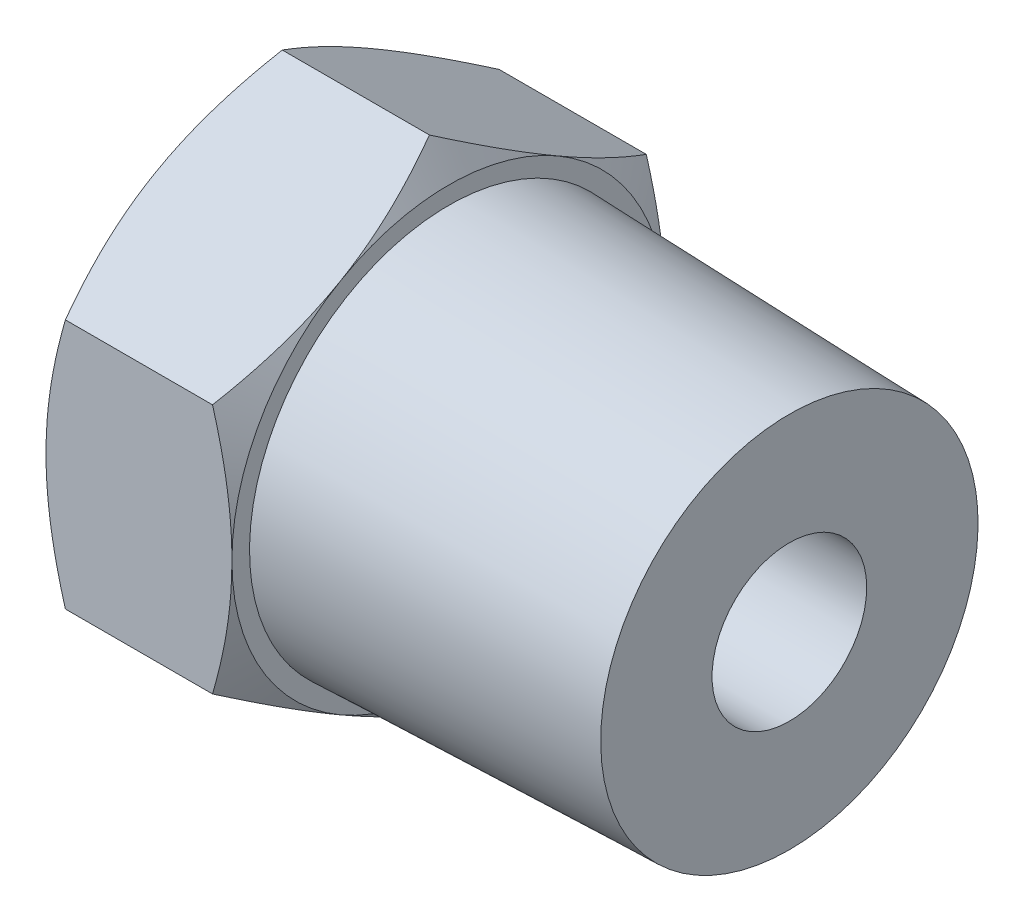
ISO-10303-21;
HEADER;
FILE_DESCRIPTION(('STEP AP214'),'2;1');
FILE_NAME('part.step','',(''),(''),'','','');
FILE_SCHEMA(('AUTOMOTIVE_DESIGN { 1 0 10303 214 1 1 1 1 }'));
ENDSEC;
DATA;
#1=APPLICATION_CONTEXT('core data for automotive mechanical design processes');
#2=APPLICATION_PROTOCOL_DEFINITION('international standard','automotive_design',2000,#1);
#3=PRODUCT_CONTEXT('',#1,'mechanical');
#4=PRODUCT('Part','Part','',(#3));
#5=PRODUCT_RELATED_PRODUCT_CATEGORY('part','',(#4));
#6=PRODUCT_DEFINITION_FORMATION('','',#4);
#7=PRODUCT_DEFINITION_CONTEXT('part definition',#1,'design');
#8=PRODUCT_DEFINITION('design','',#6,#7);
#9=PRODUCT_DEFINITION_SHAPE('','',#8);
#10=(LENGTH_UNIT() NAMED_UNIT(*) SI_UNIT(.MILLI.,.METRE.));
#11=(NAMED_UNIT(*) PLANE_ANGLE_UNIT() SI_UNIT($,.RADIAN.));
#12=(NAMED_UNIT(*) SI_UNIT($,.STERADIAN.) SOLID_ANGLE_UNIT());
#13=UNCERTAINTY_MEASURE_WITH_UNIT(LENGTH_MEASURE(1.E-05),#10,'distance_accuracy_value','');
#14=(GEOMETRIC_REPRESENTATION_CONTEXT(3) GLOBAL_UNCERTAINTY_ASSIGNED_CONTEXT((#13)) GLOBAL_UNIT_ASSIGNED_CONTEXT((#10,
#11,#12)) REPRESENTATION_CONTEXT('',''));
#15=CARTESIAN_POINT('',(0.,0.,0.));
#16=DIRECTION('',(0.,0.,1.));
#17=DIRECTION('',(1.,0.,0.));
#18=AXIS2_PLACEMENT_3D('',#15,#16,#17);
#19=CARTESIAN_POINT('',(4.791075,3.2079024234,5.55625));
#20=DIRECTION('',(0.,0.866025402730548,0.500000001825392));
#21=DIRECTION('',(0.,0.500000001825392,-0.866025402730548));
#22=AXIS2_PLACEMENT_3D('',#19,#20,#21);
#23=PLANE('',#22);
#24=CARTESIAN_POINT('',(4.76250000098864,4.81185364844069,2.7781249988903));
#25=CARTESIAN_POINT('',(4.762522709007,4.87993238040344,2.66020917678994));
#26=CARTESIAN_POINT('',(4.75961098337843,4.94800783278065,2.54229903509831));
#27=CARTESIAN_POINT('',(4.74808744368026,5.08402507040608,2.30671026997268));
#28=CARTESIAN_POINT('',(4.7394767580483,5.15196687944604,2.18903160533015));
#29=CARTESIAN_POINT('',(4.71678077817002,5.28727798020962,1.95466590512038));
#30=CARTESIAN_POINT('',(4.70272304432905,5.35464843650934,1.83797685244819));
#31=CARTESIAN_POINT('',(4.66943535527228,5.4890683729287,1.60515469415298));
#32=CARTESIAN_POINT('',(4.65020526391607,5.5561178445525,1.48902160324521));
#33=CARTESIAN_POINT('',(4.58535052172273,5.75650685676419,1.14193765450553));
#34=CARTESIAN_POINT('',(4.53252991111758,5.88926425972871,0.911995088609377));
#35=CARTESIAN_POINT('',(4.41071207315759,6.15363741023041,0.45408736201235));
#36=CARTESIAN_POINT('',(4.34163405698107,6.28524393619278,0.226138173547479));
#37=CARTESIAN_POINT('',(4.26623574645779,6.41580488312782,-1.8927537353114E-08));
#38=B_SPLINE_CURVE_WITH_KNOTS('',3,(#24,#25,#26,#27,#28,#29,#30,#31,#32,#33,#34,#35,#36,#37),
.UNSPECIFIED.,.F.,.F.,(4,2,2,2,2,2,4),(0.,0.408430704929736,0.81678056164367,1.22309071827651,
1.6294115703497,2.44098831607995,3.25668655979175),.UNSPECIFIED.);
#39=CARTESIAN_POINT('',(4.76250000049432,4.8118536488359,2.77812499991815));
#40=VERTEX_POINT('',#39);
#41=CARTESIAN_POINT('',(4.26623576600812,6.41580484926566,-3.97234481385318E-08));
#42=VERTEX_POINT('',#41);
#43=EDGE_CURVE('E326',#40,#42,#38,.T.);
#44=ORIENTED_EDGE('',*,*,#43,.T.);
#45=DIRECTION('',(1.,0.,0.));
#46=VECTOR('',#45,1.);
#47=CARTESIAN_POINT('',(2.38125,6.4158048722,0.));
#48=LINE('',#47,#46);
#49=CARTESIAN_POINT('',(0.49626424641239,6.4158048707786,2.46192904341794E-09));
#50=VERTEX_POINT('',#49);
#51=EDGE_CURVE('E336',#50,#42,#48,.T.);
#52=ORIENTED_EDGE('',*,*,#51,.F.);
#53=CARTESIAN_POINT('',(0.496264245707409,6.41580486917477,4.85708082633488E-09));
#54=CARTESIAN_POINT('',(0.420865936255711,6.28524392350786,0.226138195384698));
#55=CARTESIAN_POINT('',(0.351787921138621,6.15363739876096,0.45408738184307));
#56=CARTESIAN_POINT('',(0.22997008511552,5.88926425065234,0.911995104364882));
#57=CARTESIAN_POINT('',(0.177149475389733,5.75650684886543,1.14193766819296));
#58=CARTESIAN_POINT('',(0.112294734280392,5.55611783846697,1.48902161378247));
#59=CARTESIAN_POINT('',(0.0930646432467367,5.48906836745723,1.60515470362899));
#60=CARTESIAN_POINT('',(0.0597769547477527,5.35464843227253,1.83797685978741));
#61=CARTESIAN_POINT('',(0.0457192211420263,5.28727797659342,1.95466591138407));
#62=CARTESIAN_POINT('',(0.0230232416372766,5.1519668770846,2.18903160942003));
#63=CARTESIAN_POINT('',(0.0144125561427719,5.08402506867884,2.30671027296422));
#64=CARTESIAN_POINT('',(0.00288901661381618,4.94800783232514,2.5422990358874));
#65=CARTESIAN_POINT('',(-2.27089830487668E-05,4.87993238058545,2.66020917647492));
#66=CARTESIAN_POINT('',(-9.88643838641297E-10,4.81185364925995,2.7781249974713));
#67=B_SPLINE_CURVE_WITH_KNOTS('',3,(#53,#54,#55,#56,#57,#58,#59,#60,#61,#62,#63,#64,#65,#66),
.UNSPECIFIED.,.F.,.F.,(4,2,2,2,2,2,4),(0.,0.815698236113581,1.62727497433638,2.03359582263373,
2.43990597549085,2.84825582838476,3.25668652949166),.UNSPECIFIED.);
#68=CARTESIAN_POINT('',(0.,4.81185364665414,2.77812500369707));
#69=VERTEX_POINT('',#68);
#70=EDGE_CURVE('E368',#50,#69,#67,.T.);
#71=ORIENTED_EDGE('',*,*,#70,.T.);
#72=CARTESIAN_POINT('',(-9.88643837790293E-10,4.81185364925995,2.7781249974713));
#73=CARTESIAN_POINT('',(-2.27093693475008E-05,4.74377491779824,2.89604081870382));
#74=CARTESIAN_POINT('',(0.00288901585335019,4.67569946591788,3.01395095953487));
#75=CARTESIAN_POINT('',(0.0144125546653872,4.53968222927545,3.2495397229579));
#76=CARTESIAN_POINT('',(0.0230232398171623,4.47174042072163,3.36721838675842));
#77=CARTESIAN_POINT('',(0.0457192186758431,4.33642932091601,3.60158408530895));
#78=CARTESIAN_POINT('',(0.0597769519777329,4.26905886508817,3.71827313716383));
#79=CARTESIAN_POINT('',(0.0930646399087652,4.13463892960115,3.95109529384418));
#80=CARTESIAN_POINT('',(0.112294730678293,4.06758945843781,4.0672283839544));
#81=CARTESIAN_POINT('',(0.177149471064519,3.86720044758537,4.41431233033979));
#82=CARTESIAN_POINT('',(0.229970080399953,3.73444304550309,4.64425489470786));
#83=CARTESIAN_POINT('',(0.351787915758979,3.4700698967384,5.1021626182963));
#84=CARTESIAN_POINT('',(0.420865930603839,3.33846337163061,5.33011180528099));
#85=CARTESIAN_POINT('',(0.496264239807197,3.20790242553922,5.55624999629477));
#86=B_SPLINE_CURVE_WITH_KNOTS('',3,(#72,#73,#74,#75,#76,#77,#78,#79,#80,#81,#82,#83,#84,#85),
.UNSPECIFIED.,.F.,.F.,(4,2,2,2,2,2,4),(0.,0.408430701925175,0.816780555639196,1.22309070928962,
1.62941155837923,2.44098829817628,3.25668653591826),.UNSPECIFIED.);
#87=CARTESIAN_POINT('',(0.496264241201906,3.20790242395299,5.55625));
#88=VERTEX_POINT('',#87);
#89=EDGE_CURVE('E190',#69,#88,#86,.T.);
#90=ORIENTED_EDGE('',*,*,#89,.T.);
#91=DIRECTION('',(-1.,0.,0.));
#92=VECTOR('',#91,1.);
#93=CARTESIAN_POINT('',(2.38125,3.2079024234,5.55625));
#94=LINE('',#93,#92);
#95=CARTESIAN_POINT('',(4.26623578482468,3.20790246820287,5.55624992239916));
#96=VERTEX_POINT('',#95);
#97=EDGE_CURVE('E111',#96,#88,#94,.T.);
#98=ORIENTED_EDGE('',*,*,#97,.F.);
#99=CARTESIAN_POINT('',(4.26623581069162,3.20790251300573,5.55624984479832));
#100=CARTESIAN_POINT('',(4.34163411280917,3.33846345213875,5.3301116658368));
#101=CARTESIAN_POINT('',(4.41071212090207,3.47006997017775,5.10216249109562));
#102=CARTESIAN_POINT('',(4.53252994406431,3.73444310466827,4.64425479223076));
#103=CARTESIAN_POINT('',(4.58535054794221,3.86720049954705,4.41431224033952));
#104=CARTESIAN_POINT('',(4.65020528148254,4.06758949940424,4.06722831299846));
#105=CARTESIAN_POINT('',(4.66943537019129,4.13463896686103,3.95109522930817));
#106=CARTESIAN_POINT('',(4.70272305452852,4.26905889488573,3.71827308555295));
#107=CARTESIAN_POINT('',(4.71678078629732,4.3364293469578,3.60158404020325));
#108=CARTESIAN_POINT('',(4.73947676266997,4.47174043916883,3.36721835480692));
#109=CARTESIAN_POINT('',(4.74808744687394,4.53968224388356,3.24953969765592));
#110=CARTESIAN_POINT('',(4.7596109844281,4.67569947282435,3.01395094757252));
#111=CARTESIAN_POINT('',(4.7625227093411,4.74377492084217,2.8960408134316));
#112=CARTESIAN_POINT('',(4.76250000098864,4.81185364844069,2.7781249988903));
#113=B_SPLINE_CURVE_WITH_KNOTS('',3,(#99,#100,#101,#102,#103,#104,#105,#106,#107,#108,#109,#110,
#111,#112),.UNSPECIFIED.,.F.,.F.,(4,2,2,2,2,2,4),(0.,0.815698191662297,1.62727488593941,
2.03359571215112,2.43990584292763,2.84825567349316,3.25668635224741),.UNSPECIFIED.);
#114=EDGE_CURVE('E321',#96,#40,#113,.T.);
#115=ORIENTED_EDGE('',*,*,#114,.T.);
#116=EDGE_LOOP('',(#44,#52,#71,#90,#98,#115));
#117=FACE_BOUND('',#116,.T.);
#118=ADVANCED_FACE('F15',(#117),#23,.T.);
#119=CARTESIAN_POINT('',(4.791075,6.4158048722,0.));
#120=DIRECTION('',(0.,0.866025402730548,-0.500000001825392));
#121=DIRECTION('',(0.,-0.500000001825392,-0.866025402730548));
#122=AXIS2_PLACEMENT_3D('',#119,#120,#121);
#123=PLANE('',#122);
#124=CARTESIAN_POINT('',(4.76250000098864,4.81185364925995,-2.7781249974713));
#125=CARTESIAN_POINT('',(4.76252270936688,4.74377491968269,-2.89604081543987));
#126=CARTESIAN_POINT('',(4.75961098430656,4.67569946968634,-3.01395095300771));
#127=CARTESIAN_POINT('',(4.74808744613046,4.53968223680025,-3.24953970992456));
#128=CARTESIAN_POINT('',(4.73947676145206,4.47174043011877,-3.36721837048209));
#129=CARTESIAN_POINT('',(4.7167807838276,4.33642933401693,-3.60158406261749));
#130=CARTESIAN_POINT('',(4.70272305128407,4.26905888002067,-3.71827311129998));
#131=CARTESIAN_POINT('',(4.66943536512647,4.13463894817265,-3.95109526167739));
#132=CARTESIAN_POINT('',(4.65020527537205,4.06758947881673,-4.06722834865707));
#133=CARTESIAN_POINT('',(4.58535053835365,3.86720047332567,-4.41431228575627));
#134=CARTESIAN_POINT('',(4.53252993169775,3.73444307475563,-4.64425484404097));
#135=CARTESIAN_POINT('',(4.41071210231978,3.4700699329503,-5.10216255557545));
#136=CARTESIAN_POINT('',(4.34163409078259,3.33846341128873,-5.33011173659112));
#137=CARTESIAN_POINT('',(4.26623578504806,3.20790246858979,-5.55624992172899));
#138=B_SPLINE_CURVE_WITH_KNOTS('',3,(#124,#125,#126,#127,#128,#129,#130,#131,#132,#133,#134,
#135,#136,#137),.UNSPECIFIED.,.F.,.F.,(4,2,2,2,2,2,4),(0.,0.40843069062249,0.816780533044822,
1.22309067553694,1.62941151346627,2.44098823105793,3.25668644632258),.UNSPECIFIED.);
#139=CARTESIAN_POINT('',(4.76250000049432,4.81185365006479,-2.77812499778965));
#140=VERTEX_POINT('',#139);
#141=CARTESIAN_POINT('',(4.26623575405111,3.20790244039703,-5.55625));
#142=VERTEX_POINT('',#141);
#143=EDGE_CURVE('E282',#140,#142,#138,.T.);
#144=ORIENTED_EDGE('',*,*,#143,.T.);
#145=DIRECTION('',(1.,0.,0.));
#146=VECTOR('',#145,1.);
#147=CARTESIAN_POINT('',(2.38125,3.2079024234,-5.55625));
#148=LINE('',#147,#146);
#149=CARTESIAN_POINT('',(0.496264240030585,3.2079024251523,-5.55624999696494));
#150=VERTEX_POINT('',#149);
#151=EDGE_CURVE('E371',#150,#142,#148,.T.);
#152=ORIENTED_EDGE('',*,*,#151,.F.);
#153=CARTESIAN_POINT('',(0.496264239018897,3.20790242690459,-5.55624999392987));
#154=CARTESIAN_POINT('',(0.420865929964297,3.33846337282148,-5.33011180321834));
#155=CARTESIAN_POINT('',(0.351787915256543,3.47006989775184,-5.10216261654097));
#156=CARTESIAN_POINT('',(0.229970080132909,3.73444304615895,-4.64425489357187));
#157=CARTESIAN_POINT('',(0.177149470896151,3.86720044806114,-4.41431232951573));
#158=CARTESIAN_POINT('',(0.112294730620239,4.06758945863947,-4.0672283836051));
#159=CARTESIAN_POINT('',(0.0930646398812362,4.13463892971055,-3.95109529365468));
#160=CARTESIAN_POINT('',(0.0597769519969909,4.26905886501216,-3.71827313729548));
#161=CARTESIAN_POINT('',(0.0457192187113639,4.33642932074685,-3.60158408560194));
#162=CARTESIAN_POINT('',(0.0230232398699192,4.47174042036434,-3.36721838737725));
#163=CARTESIAN_POINT('',(0.014412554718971,4.53968222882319,-3.24953972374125));
#164=CARTESIAN_POINT('',(0.00288901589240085,4.67569946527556,-3.0139509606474));
#165=CARTESIAN_POINT('',(-2.27093456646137E-05,4.74377491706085,-2.89604081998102));
#166=CARTESIAN_POINT('',(-9.88643837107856E-10,4.81185364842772,-2.77812499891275));
#167=B_SPLINE_CURVE_WITH_KNOTS('',3,(#153,#154,#155,#156,#157,#158,#159,#160,#161,#162,#163,
#164,#165,#166),.UNSPECIFIED.,.F.,.F.,(4,2,2,2,2,2,4),(0.,0.815698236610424,1.62727497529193,
2.03359582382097,2.43990597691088,2.84825583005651,3.25668653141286),.UNSPECIFIED.);
#168=CARTESIAN_POINT('',(-4.94322106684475E-10,4.81185364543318,-2.77812500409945));
#169=VERTEX_POINT('',#168);
#170=EDGE_CURVE('E301',#150,#169,#167,.T.);
#171=ORIENTED_EDGE('',*,*,#170,.T.);
#172=CARTESIAN_POINT('',(-9.88643962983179E-10,4.81185364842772,-2.77812499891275));
#173=CARTESIAN_POINT('',(-2.27090066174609E-05,4.87993237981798,-2.66020917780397));
#174=CARTESIAN_POINT('',(0.00288901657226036,4.94800783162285,-2.54229903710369));
#175=CARTESIAN_POINT('',(0.0144125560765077,5.08402506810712,-2.30671027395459));
#176=CARTESIAN_POINT('',(0.0230232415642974,5.15196687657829,-2.18903161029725));
#177=CARTESIAN_POINT('',(0.045719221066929,5.28727797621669,-1.95466591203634));
#178=CARTESIAN_POINT('',(0.0597769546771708,5.35464843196,-1.83797686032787));
#179=CARTESIAN_POINT('',(0.0930646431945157,5.48906836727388,-1.60515470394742));
#180=CARTESIAN_POINT('',(0.112294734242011,5.55611783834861,-1.48902161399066));
#181=CARTESIAN_POINT('',(0.1771494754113,5.75650684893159,-1.14193766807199));
#182=CARTESIAN_POINT('',(0.229970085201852,5.88926425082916,-0.911995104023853));
#183=CARTESIAN_POINT('',(0.351787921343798,6.15363739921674,-0.454087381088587));
#184=CARTESIAN_POINT('',(0.420865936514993,6.28524392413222,-0.226138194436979));
#185=CARTESIAN_POINT('',(0.496264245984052,6.4158048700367,-3.74694415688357E-09));
#186=B_SPLINE_CURVE_WITH_KNOTS('',3,(#172,#173,#174,#175,#176,#177,#178,#179,#180,#181,#182,
#183,#184,#185),.UNSPECIFIED.,.F.,.F.,(4,2,2,2,2,2,4),(0.,0.408430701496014,0.816780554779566,
1.22309070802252,1.62941155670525,2.44098829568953,3.25668653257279),.UNSPECIFIED.);
#187=EDGE_CURVE('E189',#169,#50,#186,.T.);
#188=ORIENTED_EDGE('',*,*,#187,.T.);
#189=ORIENTED_EDGE('',*,*,#51,.T.);
#190=CARTESIAN_POINT('',(4.26623578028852,6.41580482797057,-8.00469063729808E-08));
#191=CARTESIAN_POINT('',(4.34163408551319,6.28524388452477,-0.226138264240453));
#192=CARTESIAN_POINT('',(4.41071209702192,6.15363736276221,-0.454087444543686));
#193=CARTESIAN_POINT('',(4.53252992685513,5.88926422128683,-0.911995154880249));
#194=CARTESIAN_POINT('',(4.58535053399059,5.7565068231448,-1.14193771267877));
#195=CARTESIAN_POINT('',(4.6502052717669,5.55611781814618,-1.48902164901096));
#196=CARTESIAN_POINT('',(4.66943536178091,5.48906834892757,-1.60515473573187));
#197=CARTESIAN_POINT('',(4.70272304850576,5.35464841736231,-1.83797688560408));
#198=CARTESIAN_POINT('',(4.71678078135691,5.28727796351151,-1.95466593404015));
#199=CARTESIAN_POINT('',(4.73947675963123,5.15196686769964,-2.18903162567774));
#200=CARTESIAN_POINT('',(4.74808744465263,5.08402506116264,-2.3067102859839));
#201=CARTESIAN_POINT('',(4.75961098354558,4.94800782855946,-2.54229904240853));
#202=CARTESIAN_POINT('',(4.76252270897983,4.87993237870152,-2.66020917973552));
#203=CARTESIAN_POINT('',(4.76250000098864,4.81185364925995,-2.7781249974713));
#204=B_SPLINE_CURVE_WITH_KNOTS('',3,(#190,#191,#192,#193,#194,#195,#196,#197,#198,#199,#200,
#201,#202,#203),.UNSPECIFIED.,.F.,.F.,(4,2,2,2,2,2,4),(0.,0.815698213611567,1.62727492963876,
2.03359576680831,2.43990590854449,2.8482557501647,3.25668643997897),.UNSPECIFIED.);
#205=EDGE_CURVE('E288',#42,#140,#204,.T.);
#206=ORIENTED_EDGE('',*,*,#205,.T.);
#207=EDGE_LOOP('',(#144,#152,#171,#188,#189,#206));
#208=FACE_BOUND('',#207,.T.);
#209=ADVANCED_FACE('F293',(#208),#123,.T.);
#210=CARTESIAN_POINT('',(4.791075,-3.2079024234,-5.55625));
#211=DIRECTION('',(0.,0.,-1.));
#212=DIRECTION('',(-1.,0.,0.));
#213=AXIS2_PLACEMENT_3D('',#210,#211,#212);
#214=PLANE('',#213);
#215=CARTESIAN_POINT('',(4.7625,-1.13960469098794E-09,-5.55625));
#216=CARTESIAN_POINT('',(4.76252270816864,-0.136157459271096,-5.55625));
#217=CARTESIAN_POINT('',(4.75961098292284,-0.27230835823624,-5.55625));
#218=CARTESIAN_POINT('',(4.74808744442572,-0.544342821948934,-5.55625));
#219=CARTESIAN_POINT('',(4.73947675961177,-0.680226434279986,-5.55625));
#220=CARTESIAN_POINT('',(4.71678078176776,-0.950848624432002,-5.55625));
#221=CARTESIAN_POINT('',(4.70272304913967,-1.08558953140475,-5.55625));
#222=CARTESIAN_POINT('',(4.66943536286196,-1.35442939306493,-5.55625));
#223=CARTESIAN_POINT('',(4.65020527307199,-1.48852833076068,-5.55625));
#224=CARTESIAN_POINT('',(4.58535053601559,-1.88930633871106,-5.55625));
#225=CARTESIAN_POINT('',(4.53252992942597,-2.1548211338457,-5.55625));
#226=CARTESIAN_POINT('',(4.41071210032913,-2.683567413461,-5.55625));
#227=CARTESIAN_POINT('',(4.34163408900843,-2.94678045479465,-5.55625));
#228=CARTESIAN_POINT('',(4.26623578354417,-3.20790233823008,-5.55625));
#229=B_SPLINE_CURVE_WITH_KNOTS('',3,(#215,#216,#217,#218,#219,#220,#221,#222,#223,#224,#225,
#226,#227,#228),.UNSPECIFIED.,.F.,.F.,(4,2,2,2,2,2,4),(0.,0.408430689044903,0.816780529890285,
1.22309067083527,1.62941150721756,2.44098822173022,3.2566864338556),.UNSPECIFIED.);
#230=CARTESIAN_POINT('',(4.7625,-1.70940703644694E-09,-5.55625));
#231=VERTEX_POINT('',#230);
#232=CARTESIAN_POINT('',(4.2662357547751,-3.20790241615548,-5.55625001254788));
#233=VERTEX_POINT('',#232);
#234=EDGE_CURVE('E256',#231,#233,#229,.T.);
#235=ORIENTED_EDGE('',*,*,#234,.T.);
#236=DIRECTION('',(1.,0.,0.));
#237=VECTOR('',#236,1.);
#238=CARTESIAN_POINT('',(2.38125,-3.2079024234,-5.55625));
#239=LINE('',#238,#237);
#240=CARTESIAN_POINT('',(0.496264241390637,-3.20790242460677,-5.55625));
#241=VERTEX_POINT('',#240);
#242=EDGE_CURVE('E376',#241,#233,#239,.T.);
#243=ORIENTED_EDGE('',*,*,#242,.F.);
#244=CARTESIAN_POINT('',(0.496264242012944,-3.20790242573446,-5.55624999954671));
#245=CARTESIAN_POINT('',(0.420865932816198,-2.94678053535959,-5.55624999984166));
#246=CARTESIAN_POINT('',(0.351787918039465,-2.68356748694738,-5.55624999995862));
#247=CARTESIAN_POINT('',(0.229970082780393,-2.15482119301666,-5.55625000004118));
#248=CARTESIAN_POINT('',(0.177149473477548,-1.88930639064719,-5.55625000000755));
#249=CARTESIAN_POINT('',(0.112294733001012,-1.48852837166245,-5.55624999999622));
#250=CARTESIAN_POINT('',(0.0930646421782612,-1.35442943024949,-5.55624999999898));
#251=CARTESIAN_POINT('',(0.0597769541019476,-1.08558956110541,-5.55625000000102));
#252=CARTESIAN_POINT('',(0.0457192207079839,-0.950848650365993,-5.55625000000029));
#253=CARTESIAN_POINT('',(0.023023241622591,-0.68022645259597,-5.55624999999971));
#254=CARTESIAN_POINT('',(0.0144125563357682,-0.544342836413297,-5.55624999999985));
#255=CARTESIAN_POINT('',(0.00288901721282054,-0.272308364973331,-5.55625000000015));
#256=CARTESIAN_POINT('',(-2.27081857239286E-05,-0.136157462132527,-5.55625000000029));
#257=CARTESIAN_POINT('',(0.,-1.24729537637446E-10,-5.55625));
#258=B_SPLINE_CURVE_WITH_KNOTS('',3,(#244,#245,#246,#247,#248,#249,#250,#251,#252,#253,#254,
#255,#256,#257),.UNSPECIFIED.,.F.,.F.,(4,2,2,2,2,2,4),(0.,0.815698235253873,1.62727497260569,
2.03359582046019,2.43990597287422,2.84825582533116,3.25668652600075),.UNSPECIFIED.);
#259=CARTESIAN_POINT('',(0.,-6.23646473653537E-11,-5.55625));
#260=VERTEX_POINT('',#259);
#261=EDGE_CURVE('E108',#241,#260,#258,.T.);
#262=ORIENTED_EDGE('',*,*,#261,.T.);
#263=CARTESIAN_POINT('',(0.,-1.24729294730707E-10,-5.55625));
#264=CARTESIAN_POINT('',(-2.27081891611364E-05,0.13615746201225,-5.55625));
#265=CARTESIAN_POINT('',(0.00288901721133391,0.272308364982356,-5.55625));
#266=CARTESIAN_POINT('',(0.0144125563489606,0.544342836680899,-5.55625));
#267=CARTESIAN_POINT('',(0.023023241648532,0.680226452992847,-5.55625));
#268=CARTESIAN_POINT('',(0.0457192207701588,0.950848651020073,-5.55625));
#269=CARTESIAN_POINT('',(0.0597769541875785,1.08558956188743,-5.55625));
#270=CARTESIAN_POINT('',(0.0930646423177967,1.35442943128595,-5.55625));
#271=CARTESIAN_POINT('',(0.112294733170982,1.48852837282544,-5.55625));
#272=CARTESIAN_POINT('',(0.177149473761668,1.88930639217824,-5.55625));
#273=CARTESIAN_POINT('',(0.229970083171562,2.1548211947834,-5.55625));
#274=CARTESIAN_POINT('',(0.351787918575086,2.68356748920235,-5.55625));
#275=CARTESIAN_POINT('',(0.420865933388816,2.94678053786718,-5.55625));
#276=CARTESIAN_POINT('',(0.496264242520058,3.2079024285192,-5.55625));
#277=B_SPLINE_CURVE_WITH_KNOTS('',3,(#263,#264,#265,#266,#267,#268,#269,#270,#271,#272,#273,
#274,#275,#276),.UNSPECIFIED.,.F.,.F.,(4,2,2,2,2,2,4),(0.,0.408430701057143,0.816780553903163,
1.22309070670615,1.6294115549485,2.44098829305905,3.2566865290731),.UNSPECIFIED.);
#278=EDGE_CURVE('E307',#260,#150,#277,.T.);
#279=ORIENTED_EDGE('',*,*,#278,.T.);
#280=ORIENTED_EDGE('',*,*,#151,.T.);
#281=CARTESIAN_POINT('',(4.26623572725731,3.20790245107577,-5.55624996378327));
#282=CARTESIAN_POINT('',(4.34163405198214,2.94678056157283,-5.55624998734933));
#283=CARTESIAN_POINT('',(4.41071207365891,2.68356751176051,-5.55624999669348));
#284=CARTESIAN_POINT('',(4.5325299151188,2.15482121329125,-5.55625000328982));
#285=CARTESIAN_POINT('',(4.5853505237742,1.88930640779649,-5.55625000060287));
#286=CARTESIAN_POINT('',(4.65020526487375,1.4885283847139,-5.55624999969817));
#287=CARTESIAN_POINT('',(4.66943535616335,1.3544294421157,-5.55624999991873));
#288=CARTESIAN_POINT('',(4.70272304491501,1.08558957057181,-5.55625000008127));
#289=CARTESIAN_POINT('',(4.71678077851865,0.950848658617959,-5.55625000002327));
#290=CARTESIAN_POINT('',(4.73947675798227,0.68022645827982,-5.55624999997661));
#291=CARTESIAN_POINT('',(4.748087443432,0.544342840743,-5.55624999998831));
#292=CARTESIAN_POINT('',(4.75961098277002,0.272308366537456,-5.5562500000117));
#293=CARTESIAN_POINT('',(4.76252270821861,0.136157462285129,-5.5562500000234));
#294=CARTESIAN_POINT('',(4.7625,-1.13960505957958E-09,-5.55625));
#295=B_SPLINE_CURVE_WITH_KNOTS('',3,(#281,#282,#283,#284,#285,#286,#287,#288,#289,#290,#291,
#292,#293,#294),.UNSPECIFIED.,.F.,.F.,(4,2,2,2,2,2,4),(0.,0.815698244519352,1.62727499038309,
2.03359584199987,2.43990599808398,2.84825585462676,3.25668655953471),.UNSPECIFIED.);
#296=EDGE_CURVE('E277',#142,#231,#295,.T.);
#297=ORIENTED_EDGE('',*,*,#296,.T.);
#298=EDGE_LOOP('',(#235,#243,#262,#279,#280,#297));
#299=FACE_BOUND('',#298,.T.);
#300=ADVANCED_FACE('F238',(#299),#214,.T.);
#301=CARTESIAN_POINT('',(4.791075,-3.2079024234,-5.55625));
#302=DIRECTION('',(0.,-0.866025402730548,-0.500000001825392));
#303=DIRECTION('',(0.,-0.500000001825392,0.866025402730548));
#304=AXIS2_PLACEMENT_3D('',#301,#302,#303);
#305=PLANE('',#304);
#306=CARTESIAN_POINT('',(4.76250000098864,-4.81185364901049,-2.77812499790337));
#307=CARTESIAN_POINT('',(4.76252270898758,-4.87993237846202,-2.66020918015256));
#308=CARTESIAN_POINT('',(4.75961098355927,-4.94800782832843,-2.54229904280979));
#309=CARTESIAN_POINT('',(4.74808744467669,-5.08402506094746,-2.3067102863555));
#310=CARTESIAN_POINT('',(4.73947675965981,-5.15196686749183,-2.18903162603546));
#311=CARTESIAN_POINT('',(4.71678078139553,-5.28727796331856,-1.95466593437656));
#312=CARTESIAN_POINT('',(4.70272304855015,-5.35464841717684,-1.83797688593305));
#313=CARTESIAN_POINT('',(4.66943536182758,-5.48906834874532,-1.60515473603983));
#314=CARTESIAN_POINT('',(4.65020527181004,-5.55611781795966,-1.48902164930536));
#315=CARTESIAN_POINT('',(4.58535053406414,-5.75650682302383,-1.14193771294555));
#316=CARTESIAN_POINT('',(4.53252992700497,-5.88926422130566,-0.911995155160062));
#317=CARTESIAN_POINT('',(4.41071209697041,-6.15363736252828,-0.45408744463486));
#318=CARTESIAN_POINT('',(4.34163408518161,-6.28524388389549,-0.226138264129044));
#319=CARTESIAN_POINT('',(4.26623577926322,-6.41580482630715,-7.94887462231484E-08));
#320=B_SPLINE_CURVE_WITH_KNOTS('',3,(#306,#307,#308,#309,#310,#311,#312,#313,#314,#315,#316,
#317,#318,#319),.UNSPECIFIED.,.F.,.F.,(4,2,2,2,2,2,4),(0.,0.408430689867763,0.816780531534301,
1.22309067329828,1.62941151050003,2.44098822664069,3.25668644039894),.UNSPECIFIED.);
#321=CARTESIAN_POINT('',(4.76250000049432,-4.81185364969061,-2.77812499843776));
#322=VERTEX_POINT('',#321);
#323=CARTESIAN_POINT('',(4.26623574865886,-6.41580487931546,-1.23243365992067E-08));
#324=VERTEX_POINT('',#323);
#325=EDGE_CURVE('E243',#322,#324,#320,.T.);
#326=ORIENTED_EDGE('',*,*,#325,.T.);
#327=DIRECTION('',(1.,0.,0.));
#328=VECTOR('',#327,1.);
#329=CARTESIAN_POINT('',(2.38125,-6.4158048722,0.));
#330=LINE('',#329,#328);
#331=CARTESIAN_POINT('',(0.496264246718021,-6.41580487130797,-1.54503742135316E-09));
#332=VERTEX_POINT('',#331);
#333=EDGE_CURVE('E130',#332,#324,#330,.T.);
#334=ORIENTED_EDGE('',*,*,#333,.F.);
#335=CARTESIAN_POINT('',(0.496264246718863,-6.41580486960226,-2.79224623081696E-09));
#336=CARTESIAN_POINT('',(0.420865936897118,-6.28524392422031,-0.226138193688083));
#337=CARTESIAN_POINT('',(0.351787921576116,-6.15363739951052,-0.454087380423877));
#338=CARTESIAN_POINT('',(0.229970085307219,-5.88926425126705,-0.911995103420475));
#339=CARTESIAN_POINT('',(0.177149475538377,-5.75650684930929,-1.14193766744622));
#340=CARTESIAN_POINT('',(0.11229473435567,-5.55611783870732,-1.48902161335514));
#341=CARTESIAN_POINT('',(0.0930646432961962,-5.48906836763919,-1.60515470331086));
#342=CARTESIAN_POINT('',(0.0597769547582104,-5.35464843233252,-1.83797685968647));
#343=CARTESIAN_POINT('',(0.0457192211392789,-5.28727797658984,-1.95466591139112));
#344=CARTESIAN_POINT('',(0.0230232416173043,-5.15196687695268,-2.18903160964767));
#345=CARTESIAN_POINT('',(0.0144125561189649,-5.08402506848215,-2.30671027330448));
#346=CARTESIAN_POINT('',(0.00288901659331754,-4.94800783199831,-2.54229903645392));
#347=CARTESIAN_POINT('',(-2.27089963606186E-05,-4.87993238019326,-2.66020917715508));
#348=CARTESIAN_POINT('',(-9.88643713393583E-10,-4.81185364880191,-2.77812499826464));
#349=B_SPLINE_CURVE_WITH_KNOTS('',3,(#335,#336,#337,#338,#339,#340,#341,#342,#343,#344,#345,
#346,#347,#348),.UNSPECIFIED.,.F.,.F.,(4,2,2,2,2,2,4),(0.,0.815698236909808,1.62727497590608,
2.03359582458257,2.4399059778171,2.84825583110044,3.25668653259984),.UNSPECIFIED.);
#350=CARTESIAN_POINT('',(-4.94321981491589E-10,-4.81185364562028,-2.77812500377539));
#351=VERTEX_POINT('',#350);
#352=EDGE_CURVE('E127',#332,#351,#349,.T.);
#353=ORIENTED_EDGE('',*,*,#352,.T.);
#354=CARTESIAN_POINT('',(-9.88643587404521E-10,-4.81185364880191,-2.77812499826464));
#355=CARTESIAN_POINT('',(-2.27093563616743E-05,-4.74377491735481,-2.89604081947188));
#356=CARTESIAN_POINT('',(0.00288901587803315,-4.67569946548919,-3.01395096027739));
#357=CARTESIAN_POINT('',(0.0144125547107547,-4.53968222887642,-3.24953972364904));
#358=CARTESIAN_POINT('',(0.0230232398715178,-4.47174042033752,-3.3672183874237));
#359=CARTESIAN_POINT('',(0.045719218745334,-4.33642932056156,-3.60158408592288));
#360=CARTESIAN_POINT('',(0.0597769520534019,-4.26905886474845,-3.71827313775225));
#361=CARTESIAN_POINT('',(0.0930646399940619,-4.13463892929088,-3.95109529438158));
#362=CARTESIAN_POINT('',(0.112294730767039,-4.06758945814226,-4.0672283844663));
#363=CARTESIAN_POINT('',(0.177149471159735,-3.86720044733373,-4.41431233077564));
#364=CARTESIAN_POINT('',(0.229970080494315,-3.7344430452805,-4.64425489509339));
#365=CARTESIAN_POINT('',(0.351787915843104,-3.47006989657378,-5.10216261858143));
#366=CARTESIAN_POINT('',(0.420865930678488,-3.3384633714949,-5.33011180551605));
#367=CARTESIAN_POINT('',(0.496264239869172,-3.20790242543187,-5.5562499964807));
#368=B_SPLINE_CURVE_WITH_KNOTS('',3,(#354,#355,#356,#357,#358,#359,#360,#361,#362,#363,#364,
#365,#366,#367),.UNSPECIFIED.,.F.,.F.,(4,2,2,2,2,2,4),(0.,0.408430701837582,0.816780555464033,
1.22309070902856,1.62941155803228,2.44098829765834,3.25668653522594),.UNSPECIFIED.);
#369=EDGE_CURVE('E103',#351,#241,#368,.T.);
#370=ORIENTED_EDGE('',*,*,#369,.T.);
#371=ORIENTED_EDGE('',*,*,#242,.T.);
#372=CARTESIAN_POINT('',(4.2662357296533,-3.20790238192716,-5.55625000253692));
#373=CARTESIAN_POINT('',(4.34163405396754,-3.33846334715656,-5.33011182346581));
#374=CARTESIAN_POINT('',(4.41071207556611,-3.47006988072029,-5.10216263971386));
#375=CARTESIAN_POINT('',(4.53252991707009,-3.73444303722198,-4.6442549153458));
#376=CARTESIAN_POINT('',(4.58535052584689,-3.86720043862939,-4.41431234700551));
#377=CARTESIAN_POINT('',(4.65020526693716,-4.06758945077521,-4.0672283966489));
#378=CARTESIAN_POINT('',(4.66943535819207,-4.13463892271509,-3.95109530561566));
#379=CARTESIAN_POINT('',(4.70272304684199,-4.26905885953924,-3.71827314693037));
#380=CARTESIAN_POINT('',(4.71678078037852,-4.33642931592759,-3.60158409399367));
#381=CARTESIAN_POINT('',(4.73947675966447,-4.47174041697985,-3.36721839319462));
#382=CARTESIAN_POINT('',(4.74808744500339,-4.53968222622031,-3.24953972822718));
#383=CARTESIAN_POINT('',(4.75961098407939,-4.67569946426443,-3.01395096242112));
#384=CARTESIAN_POINT('',(4.76252270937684,-4.74377491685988,-2.89604082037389));
#385=CARTESIAN_POINT('',(4.76250000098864,-4.81185364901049,-2.77812499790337));
#386=B_SPLINE_CURVE_WITH_KNOTS('',3,(#372,#373,#374,#375,#376,#377,#378,#379,#380,#381,#382,
#383,#384,#385),.UNSPECIFIED.,.F.,.F.,(4,2,2,2,2,2,4),(0.,0.815698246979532,1.62727499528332,
2.0335958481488,2.43990600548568,2.84825586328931,3.25668656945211),.UNSPECIFIED.);
#387=EDGE_CURVE('E249',#233,#322,#386,.T.);
#388=ORIENTED_EDGE('',*,*,#387,.T.);
#389=EDGE_LOOP('',(#326,#334,#353,#370,#371,#388));
#390=FACE_BOUND('',#389,.T.);
#391=ADVANCED_FACE('F129',(#390),#305,.T.);
#392=CARTESIAN_POINT('',(4.791075,-6.4158048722,0.));
#393=DIRECTION('',(0.,-0.866025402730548,0.500000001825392));
#394=DIRECTION('',(0.,0.500000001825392,0.866025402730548));
#395=AXIS2_PLACEMENT_3D('',#392,#393,#394);
#396=PLANE('',#395);
#397=CARTESIAN_POINT('',(4.76250000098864,-4.81185364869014,2.77812499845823));
#398=CARTESIAN_POINT('',(4.76252270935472,-4.74377491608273,2.89604082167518));
#399=CARTESIAN_POINT('',(4.75961098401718,-4.6756994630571,3.01395096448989));
#400=CARTESIAN_POINT('',(4.74808744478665,-4.53968222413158,3.24953973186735));
#401=CARTESIAN_POINT('',(4.73947675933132,-4.47174041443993,3.36721839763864));
#402=CARTESIAN_POINT('',(4.71678077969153,-4.33642931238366,3.6015841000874));
#403=CARTESIAN_POINT('',(4.70272304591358,-4.26905885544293,3.71827315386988));
#404=CARTESIAN_POINT('',(4.66943535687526,-4.13463891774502,3.95109531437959));
#405=CARTESIAN_POINT('',(4.65020526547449,-4.0675894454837,4.06722840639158));
#406=CARTESIAN_POINT('',(4.58535052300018,-3.86720043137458,4.41431235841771));
#407=CARTESIAN_POINT('',(4.53252991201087,-3.73444302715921,4.64425492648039));
#408=CARTESIAN_POINT('',(4.41071207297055,-3.47006987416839,5.10216265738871));
#409=CARTESIAN_POINT('',(4.34163405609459,-3.3384633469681,5.33011184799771));
#410=CARTESIAN_POINT('',(4.26623574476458,-3.20790239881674,5.55625004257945));
#411=B_SPLINE_CURVE_WITH_KNOTS('',3,(#397,#398,#399,#400,#401,#402,#403,#404,#405,#406,#407,
#408,#409,#410),.UNSPECIFIED.,.F.,.F.,(4,2,2,2,2,2,4),(0.,0.408430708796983,0.81678056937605,
1.22309072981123,1.62941158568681,2.44098833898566,3.25668659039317),.UNSPECIFIED.);
#412=CARTESIAN_POINT('',(4.76250000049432,-4.81185364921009,2.77812499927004));
#413=VERTEX_POINT('',#412);
#414=CARTESIAN_POINT('',(4.26623578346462,-3.20790233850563,5.55625));
#415=VERTEX_POINT('',#414);
#416=EDGE_CURVE('E34',#413,#415,#411,.T.);
#417=ORIENTED_EDGE('',*,*,#416,.T.);
#418=DIRECTION('',(1.,0.,0.));
#419=VECTOR('',#418,1.);
#420=CARTESIAN_POINT('',(2.38125,-3.2079024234,5.55625));
#421=LINE('',#420,#419);
#422=CARTESIAN_POINT('',(0.496264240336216,-3.20790242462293,5.55624999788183));
#423=VERTEX_POINT('',#422);
#424=EDGE_CURVE('E596',#423,#415,#421,.T.);
#425=ORIENTED_EDGE('',*,*,#424,.F.);
#426=CARTESIAN_POINT('',(0.496264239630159,-3.20790242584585,5.55624999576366));
#427=CARTESIAN_POINT('',(0.420865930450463,-3.33846337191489,5.3301118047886));
#428=CARTESIAN_POINT('',(0.351787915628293,-3.47006989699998,5.10216261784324));
#429=CARTESIAN_POINT('',(0.229970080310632,-3.73444304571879,4.64425489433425));
#430=CARTESIAN_POINT('',(0.177149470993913,-3.86720044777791,4.41431233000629));
#431=CARTESIAN_POINT('',(0.112294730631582,-4.06758945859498,4.06722838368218));
#432=CARTESIAN_POINT('',(0.0930646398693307,-4.13463892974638,3.95109529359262));
#433=CARTESIAN_POINT('',(0.0597769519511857,-4.26905886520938,3.7182731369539));
#434=CARTESIAN_POINT('',(0.0457192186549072,-4.33642932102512,3.60158408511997));
#435=CARTESIAN_POINT('',(0.0230232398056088,-4.47174042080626,3.36721838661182));
#436=CARTESIAN_POINT('',(0.0144125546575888,-4.53968222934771,3.24953972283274));
#437=CARTESIAN_POINT('',(0.00288901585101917,-4.6756994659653,3.01395095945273));
#438=CARTESIAN_POINT('',(-2.27093699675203E-05,-4.7437749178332,2.89604081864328));
#439=CARTESIAN_POINT('',(-9.88643962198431E-10,-4.81185364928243,2.77812499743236));
#440=B_SPLINE_CURVE_WITH_KNOTS('',3,(#426,#427,#428,#429,#430,#431,#432,#433,#434,#435,#436,
#437,#438,#439),.UNSPECIFIED.,.F.,.F.,(4,2,2,2,2,2,4),(0.,0.815698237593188,1.62727497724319,
2.03359582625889,2.43990597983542,2.84825583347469,3.25668653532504),.UNSPECIFIED.);
#441=CARTESIAN_POINT('',(-4.94321668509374E-10,-4.81185364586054,2.77812500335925));
#442=VERTEX_POINT('',#441);
#443=EDGE_CURVE('E219',#423,#442,#440,.T.);
#444=ORIENTED_EDGE('',*,*,#443,.T.);
#445=CARTESIAN_POINT('',(-9.88643462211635E-10,-4.81185364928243,2.77812499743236));
#446=CARTESIAN_POINT('',(-2.27089823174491E-05,-4.87993238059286,2.66020917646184));
#447=CARTESIAN_POINT('',(0.00288901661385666,-4.94800783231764,2.54229903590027));
#448=CARTESIAN_POINT('',(0.0144125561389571,-5.08402506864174,2.3067102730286));
#449=CARTESIAN_POINT('',(0.02302324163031,-5.15196687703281,2.18903160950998));
#450=CARTESIAN_POINT('',(0.0457192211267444,-5.28727797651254,1.95466591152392));
#451=CARTESIAN_POINT('',(0.059776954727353,-5.35464843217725,1.83797685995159));
#452=CARTESIAN_POINT('',(0.0930646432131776,-5.48906836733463,1.6051547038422));
#453=CARTESIAN_POINT('',(0.112294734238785,-5.55611783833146,1.48902161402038));
#454=CARTESIAN_POINT('',(0.177149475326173,-5.75650684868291,1.14193766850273));
#455=CARTESIAN_POINT('',(0.22997008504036,-5.88926425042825,0.911995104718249));
#456=CARTESIAN_POINT('',(0.351787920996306,-6.15363739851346,0.454087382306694));
#457=CARTESIAN_POINT('',(0.420865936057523,-6.28524392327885,0.226138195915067));
#458=CARTESIAN_POINT('',(0.49626424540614,-6.41580486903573,5.48067982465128E-09));
#459=B_SPLINE_CURVE_WITH_KNOTS('',3,(#445,#446,#447,#448,#449,#450,#451,#452,#453,#454,#455,
#456,#457,#458),.UNSPECIFIED.,.F.,.F.,(4,2,2,2,2,2,4),(0.,0.408430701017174,0.816780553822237,
1.22309070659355,1.6294115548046,2.44098829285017,3.25668652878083),.UNSPECIFIED.);
#460=EDGE_CURVE('E134',#442,#332,#459,.T.);
#461=ORIENTED_EDGE('',*,*,#460,.T.);
#462=ORIENTED_EDGE('',*,*,#333,.T.);
#463=CARTESIAN_POINT('',(4.26623572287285,-6.41580485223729,-3.71644108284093E-08));
#464=CARTESIAN_POINT('',(4.34163404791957,-6.28524392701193,0.226138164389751));
#465=CARTESIAN_POINT('',(4.41071207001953,-6.15363740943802,0.454087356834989));
#466=CARTESIAN_POINT('',(4.53252991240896,-5.88926426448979,0.911995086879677));
#467=CARTESIAN_POINT('',(4.58535052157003,-5.75650685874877,1.14193765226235));
#468=CARTESIAN_POINT('',(4.65020526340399,-5.5561178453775,1.48902160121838));
#469=CARTESIAN_POINT('',(4.66943535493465,-5.48906837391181,1.60515469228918));
#470=CARTESIAN_POINT('',(4.70272304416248,-5.3546484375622,1.83797685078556));
#471=CARTESIAN_POINT('',(4.71678077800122,-5.2872779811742,1.95466590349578));
#472=CARTESIAN_POINT('',(4.73947675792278,-5.15196688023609,2.18903160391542));
#473=CARTESIAN_POINT('',(4.74808744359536,-5.08402507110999,2.30671026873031));
#474=CARTESIAN_POINT('',(4.75961098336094,-4.94800783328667,2.54229903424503));
#475=CARTESIAN_POINT('',(4.76252270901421,-4.87993238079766,2.66020917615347));
#476=CARTESIAN_POINT('',(4.76250000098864,-4.81185364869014,2.77812499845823));
#477=B_SPLINE_CURVE_WITH_KNOTS('',3,(#463,#464,#465,#466,#467,#468,#469,#470,#471,#472,#473,
#474,#475,#476),.UNSPECIFIED.,.F.,.F.,(4,2,2,2,2,2,4),(0.,0.815698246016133,1.6272749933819,
2.03359584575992,2.43990600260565,2.84825585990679,3.25668656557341),.UNSPECIFIED.);
#478=EDGE_CURVE('E599',#324,#413,#477,.T.);
#479=ORIENTED_EDGE('',*,*,#478,.T.);
#480=EDGE_LOOP('',(#417,#425,#444,#461,#462,#479));
#481=FACE_BOUND('',#480,.T.);
#482=ADVANCED_FACE('F163',(#481),#396,.T.);
#483=CARTESIAN_POINT('',(-0.028575,-3.2079024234,5.55625));
#484=DIRECTION('',(0.,0.,1.));
#485=DIRECTION('',(1.,0.,0.));
#486=AXIS2_PLACEMENT_3D('',#483,#484,#485);
#487=PLANE('',#486);
#488=CARTESIAN_POINT('',(4.7625,-1.24729294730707E-10,5.55625));
#489=CARTESIAN_POINT('',(4.76252270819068,0.136157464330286,5.55625));
#490=CARTESIAN_POINT('',(4.75961098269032,0.27230836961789,5.55625));
#491=CARTESIAN_POINT('',(4.74808744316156,0.544342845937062,5.55625));
#492=CARTESIAN_POINT('',(4.73947675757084,0.680226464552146,5.55625));
#493=CARTESIAN_POINT('',(4.71678077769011,0.950848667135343,5.55625));
#494=CARTESIAN_POINT('',(4.70272304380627,1.0855895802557,5.55625));
#495=CARTESIAN_POINT('',(4.66943535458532,1.35442945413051,5.55625));
#496=CARTESIAN_POINT('',(4.65020526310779,1.48852839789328,5.55625));
#497=CARTESIAN_POINT('',(4.58535052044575,1.88930642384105,5.55625));
#498=CARTESIAN_POINT('',(4.53252990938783,2.15482123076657,5.55625));
#499=CARTESIAN_POINT('',(4.4107120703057,2.68356753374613,5.55625));
#500=CARTESIAN_POINT('',(4.3416340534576,2.9467805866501,5.55625));
#501=CARTESIAN_POINT('',(4.26623574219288,3.20790248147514,5.55625));
#502=B_SPLINE_CURVE_WITH_KNOTS('',3,(#488,#489,#490,#491,#492,#493,#494,#495,#496,#497,#498,
#499,#500,#501),.UNSPECIFIED.,.F.,.F.,(4,2,2,2,2,2,4),(0.,0.408430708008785,0.816780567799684,
1.22309072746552,1.62941158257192,2.44098833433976,3.25668658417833),.UNSPECIFIED.);
#503=CARTESIAN_POINT('',(4.7625,-6.23646473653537E-11,5.55625));
#504=VERTEX_POINT('',#503);
#505=EDGE_CURVE('E173',#504,#96,#502,.T.);
#506=ORIENTED_EDGE('',*,*,#505,.T.);
#507=ORIENTED_EDGE('',*,*,#97,.T.);
#508=CARTESIAN_POINT('',(0.496264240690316,3.20790242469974,5.55625000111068));
#509=CARTESIAN_POINT('',(0.420865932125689,2.94678053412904,5.55625000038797));
#510=CARTESIAN_POINT('',(0.351787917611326,2.68356748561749,5.5562500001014));
#511=CARTESIAN_POINT('',(0.229970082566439,2.15482119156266,5.55624999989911));
#512=CARTESIAN_POINT('',(0.17714947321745,1.88930638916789,5.55624999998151));
#513=CARTESIAN_POINT('',(0.11229473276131,1.48852837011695,5.55625000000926));
#514=CARTESIAN_POINT('',(0.0930646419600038,1.35442942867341,5.55625000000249));
#515=CARTESIAN_POINT('',(0.0597769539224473,1.08558955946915,5.55624999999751));
#516=CARTESIAN_POINT('',(0.0457192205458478,0.950848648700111,5.55624999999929));
#517=CARTESIAN_POINT('',(0.0230232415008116,0.680226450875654,5.55625000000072));
#518=CARTESIAN_POINT('',(0.0144125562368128,0.544342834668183,5.55625000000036));
#519=CARTESIAN_POINT('',(0.00288901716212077,0.272308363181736,5.55624999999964));
#520=CARTESIAN_POINT('',(-2.27082110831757E-05,0.136157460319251,5.55624999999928));
#521=CARTESIAN_POINT('',(0.,-1.70940732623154E-09,5.55625));
#522=B_SPLINE_CURVE_WITH_KNOTS('',3,(#508,#509,#510,#511,#512,#513,#514,#515,#516,#517,#518,
#519,#520,#521),.UNSPECIFIED.,.F.,.F.,(4,2,2,2,2,2,4),(0.,0.815698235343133,1.62727497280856,
2.03359582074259,2.4399059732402,2.84825582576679,3.25668652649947),.UNSPECIFIED.);
#523=CARTESIAN_POINT('',(0.,-1.13960469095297E-09,5.55625));
#524=VERTEX_POINT('',#523);
#525=EDGE_CURVE('E181',#88,#524,#522,.T.);
#526=ORIENTED_EDGE('',*,*,#525,.T.);
#527=CARTESIAN_POINT('',(0.,-1.70940703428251E-09,5.55625));
#528=CARTESIAN_POINT('',(-2.27081630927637E-05,-0.136157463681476,5.55625));
#529=CARTESIAN_POINT('',(0.00288901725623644,-0.272308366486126,5.55625));
#530=CARTESIAN_POINT('',(0.0144125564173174,-0.544342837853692,5.55625));
#531=CARTESIAN_POINT('',(0.0230232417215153,-0.680226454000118,5.55625));
#532=CARTESIAN_POINT('',(0.0457192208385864,-0.950848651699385,5.55625));
#533=CARTESIAN_POINT('',(0.0597769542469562,-1.08558956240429,5.55625));
#534=CARTESIAN_POINT('',(0.0930646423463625,-1.35442943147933,5.55625));
#535=CARTESIAN_POINT('',(0.112294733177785,-1.48852837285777,5.55625));
#536=CARTESIAN_POINT('',(0.177149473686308,-1.88930639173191,5.55625));
#537=CARTESIAN_POINT('',(0.229970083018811,-2.15482119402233,5.55625));
#538=CARTESIAN_POINT('',(0.35178791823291,-2.68356748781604,5.55625));
#539=CARTESIAN_POINT('',(0.420865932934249,-2.94678053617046,5.55625));
#540=CARTESIAN_POINT('',(0.496264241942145,-3.20790242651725,5.55625));
#541=B_SPLINE_CURVE_WITH_KNOTS('',3,(#527,#528,#529,#530,#531,#532,#533,#534,#535,#536,#537,
#538,#539,#540),.UNSPECIFIED.,.F.,.F.,(4,2,2,2,2,2,4),(0.,0.408430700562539,0.816780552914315,
1.22309070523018,1.62941155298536,2.44098829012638,3.25668652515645),.UNSPECIFIED.);
#542=EDGE_CURVE('E133',#524,#423,#541,.T.);
#543=ORIENTED_EDGE('',*,*,#542,.T.);
#544=ORIENTED_EDGE('',*,*,#424,.T.);
#545=CARTESIAN_POINT('',(4.26623580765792,-3.20790225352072,5.55624999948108));
#546=CARTESIAN_POINT('',(4.34163410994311,-2.94678037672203,5.55624999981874));
#547=CARTESIAN_POINT('',(4.41071211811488,-2.68356734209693,5.55624999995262));
#548=CARTESIAN_POINT('',(4.53252994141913,-2.15482107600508,5.55625000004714));
#549=CARTESIAN_POINT('',(4.58535054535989,-1.88930628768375,5.55625000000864));
#550=CARTESIAN_POINT('',(4.65020527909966,-1.48852829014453,5.55624999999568));
#551=CARTESIAN_POINT('',(4.66943536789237,-1.35442935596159,5.55624999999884));
#552=CARTESIAN_POINT('',(4.70272305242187,-1.08558950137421,5.55625000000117));
#553=CARTESIAN_POINT('',(4.71678078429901,-0.950848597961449,5.55625000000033));
#554=CARTESIAN_POINT('',(4.73947676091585,-0.680226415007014,5.55624999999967));
#555=CARTESIAN_POINT('',(4.74808744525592,-0.544342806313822,5.55624999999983));
#556=CARTESIAN_POINT('',(4.75961098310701,-0.272308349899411,5.55625000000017));
#557=CARTESIAN_POINT('',(4.76252270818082,-0.136157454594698,5.55625000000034));
#558=CARTESIAN_POINT('',(4.7625,-1.24729601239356E-10,5.55625));
#559=B_SPLINE_CURVE_WITH_KNOTS('',3,(#545,#546,#547,#548,#549,#550,#551,#552,#553,#554,#555,
#556,#557,#558),.UNSPECIFIED.,.F.,.F.,(4,2,2,2,2,2,4),(0.,0.815698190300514,1.62727488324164,
2.03359570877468,2.43990583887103,2.84825566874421,3.2566863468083),.UNSPECIFIED.);
#560=EDGE_CURVE('E124',#415,#504,#559,.T.);
#561=ORIENTED_EDGE('',*,*,#560,.T.);
#562=EDGE_LOOP('',(#506,#507,#526,#543,#544,#561));
#563=FACE_BOUND('',#562,.T.);
#564=ADVANCED_FACE('F159',(#563),#487,.T.);
#565=CARTESIAN_POINT('',(0.,0.,0.));
#566=DIRECTION('',(1.,0.,0.));
#567=DIRECTION('',(0.,0.,-1.));
#568=AXIS2_PLACEMENT_3D('',#565,#566,#567);
#569=CONICAL_SURFACE('',#568,5.55625,1.04719754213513);
#570=ORIENTED_EDGE('',*,*,#369,.F.);
#571=CARTESIAN_POINT('',(0.,0.,0.));
#572=DIRECTION('',(1.,0.,0.));
#573=DIRECTION('',(0.,0.,-1.));
#574=AXIS2_PLACEMENT_3D('',#571,#572,#573);
#575=CIRCLE('',#574,5.55625);
#576=EDGE_CURVE('E106',#260,#351,#575,.F.);
#577=ORIENTED_EDGE('',*,*,#576,.F.);
#578=ORIENTED_EDGE('',*,*,#261,.F.);
#579=EDGE_LOOP('',(#570,#577,#578));
#580=FACE_BOUND('',#579,.T.);
#581=ADVANCED_FACE('F105',(#580),#569,.T.);
#582=CARTESIAN_POINT('',(0.,0.,0.));
#583=DIRECTION('',(1.,0.,0.));
#584=DIRECTION('',(0.,0.,-1.));
#585=AXIS2_PLACEMENT_3D('',#582,#583,#584);
#586=CONICAL_SURFACE('',#585,5.55625,1.04719754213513);
#587=ORIENTED_EDGE('',*,*,#460,.F.);
#588=CARTESIAN_POINT('',(0.,0.,0.));
#589=DIRECTION('',(1.,0.,0.));
#590=DIRECTION('',(0.,0.,-1.));
#591=AXIS2_PLACEMENT_3D('',#588,#589,#590);
#592=CIRCLE('',#591,5.55625);
#593=EDGE_CURVE('E120',#351,#442,#592,.F.);
#594=ORIENTED_EDGE('',*,*,#593,.F.);
#595=ORIENTED_EDGE('',*,*,#352,.F.);
#596=EDGE_LOOP('',(#587,#594,#595));
#597=FACE_BOUND('',#596,.T.);
#598=ADVANCED_FACE('F136',(#597),#586,.T.);
#599=CARTESIAN_POINT('',(0.,0.,0.));
#600=DIRECTION('',(1.,0.,0.));
#601=DIRECTION('',(0.,0.,-1.));
#602=AXIS2_PLACEMENT_3D('',#599,#600,#601);
#603=CONICAL_SURFACE('',#602,5.55625,1.04719754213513);
#604=ORIENTED_EDGE('',*,*,#542,.F.);
#605=CARTESIAN_POINT('',(0.,0.,0.));
#606=DIRECTION('',(1.,0.,0.));
#607=DIRECTION('',(0.,0.,-1.));
#608=AXIS2_PLACEMENT_3D('',#605,#606,#607);
#609=CIRCLE('',#608,5.55625);
#610=EDGE_CURVE('E137',#442,#524,#609,.F.);
#611=ORIENTED_EDGE('',*,*,#610,.F.);
#612=ORIENTED_EDGE('',*,*,#443,.F.);
#613=EDGE_LOOP('',(#604,#611,#612));
#614=FACE_BOUND('',#613,.T.);
#615=ADVANCED_FACE('F207',(#614),#603,.T.);
#616=CARTESIAN_POINT('',(0.,0.,0.));
#617=DIRECTION('',(1.,0.,0.));
#618=DIRECTION('',(0.,0.,-1.));
#619=AXIS2_PLACEMENT_3D('',#616,#617,#618);
#620=CONICAL_SURFACE('',#619,5.55625,1.04719754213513);
#621=ORIENTED_EDGE('',*,*,#89,.F.);
#622=CARTESIAN_POINT('',(0.,0.,0.));
#623=DIRECTION('',(1.,0.,0.));
#624=DIRECTION('',(0.,0.,-1.));
#625=AXIS2_PLACEMENT_3D('',#622,#623,#624);
#626=CIRCLE('',#625,5.55625);
#627=EDGE_CURVE('E139',#524,#69,#626,.F.);
#628=ORIENTED_EDGE('',*,*,#627,.F.);
#629=ORIENTED_EDGE('',*,*,#525,.F.);
#630=EDGE_LOOP('',(#621,#628,#629));
#631=FACE_BOUND('',#630,.T.);
#632=ADVANCED_FACE('F202',(#631),#620,.T.);
#633=CARTESIAN_POINT('',(0.,0.,0.));
#634=DIRECTION('',(1.,0.,0.));
#635=DIRECTION('',(0.,0.,-1.));
#636=AXIS2_PLACEMENT_3D('',#633,#634,#635);
#637=CONICAL_SURFACE('',#636,5.55625,1.04719754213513);
#638=ORIENTED_EDGE('',*,*,#70,.F.);
#639=ORIENTED_EDGE('',*,*,#187,.F.);
#640=CARTESIAN_POINT('',(0.,0.,0.));
#641=DIRECTION('',(1.,0.,0.));
#642=DIRECTION('',(0.,0.,-1.));
#643=AXIS2_PLACEMENT_3D('',#640,#641,#642);
#644=CIRCLE('',#643,5.55625);
#645=EDGE_CURVE('E359',#69,#169,#644,.F.);
#646=ORIENTED_EDGE('',*,*,#645,.F.);
#647=EDGE_LOOP('',(#638,#639,#646));
#648=FACE_BOUND('',#647,.T.);
#649=ADVANCED_FACE('F206',(#648),#637,.T.);
#650=CARTESIAN_POINT('',(0.,0.,0.));
#651=DIRECTION('',(1.,0.,0.));
#652=DIRECTION('',(0.,0.,-1.));
#653=AXIS2_PLACEMENT_3D('',#650,#651,#652);
#654=CONICAL_SURFACE('',#653,5.55625,1.04719754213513);
#655=ORIENTED_EDGE('',*,*,#278,.F.);
#656=CARTESIAN_POINT('',(0.,0.,0.));
#657=DIRECTION('',(1.,0.,0.));
#658=DIRECTION('',(0.,0.,-1.));
#659=AXIS2_PLACEMENT_3D('',#656,#657,#658);
#660=CIRCLE('',#659,5.55625);
#661=EDGE_CURVE('E123',#169,#260,#660,.F.);
#662=ORIENTED_EDGE('',*,*,#661,.F.);
#663=ORIENTED_EDGE('',*,*,#170,.F.);
#664=EDGE_LOOP('',(#655,#662,#663));
#665=FACE_BOUND('',#664,.T.);
#666=ADVANCED_FACE('F311',(#665),#654,.T.);
#667=CARTESIAN_POINT('',(4.7625,0.,0.));
#668=DIRECTION('',(-1.,0.,0.));
#669=DIRECTION('',(0.,0.,1.));
#670=AXIS2_PLACEMENT_3D('',#667,#668,#669);
#671=CONICAL_SURFACE('',#670,5.55625,1.04719754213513);
#672=ORIENTED_EDGE('',*,*,#505,.F.);
#673=CARTESIAN_POINT('',(4.7625,0.,0.));
#674=DIRECTION('',(-1.,0.,0.));
#675=DIRECTION('',(0.,0.,1.));
#676=AXIS2_PLACEMENT_3D('',#673,#674,#675);
#677=CIRCLE('',#676,5.55625);
#678=EDGE_CURVE('E353',#504,#40,#677,.T.);
#679=ORIENTED_EDGE('',*,*,#678,.T.);
#680=ORIENTED_EDGE('',*,*,#114,.F.);
#681=EDGE_LOOP('',(#672,#679,#680));
#682=FACE_BOUND('',#681,.T.);
#683=ADVANCED_FACE('F314',(#682),#671,.T.);
#684=CARTESIAN_POINT('',(4.7625,0.,0.));
#685=DIRECTION('',(-1.,0.,0.));
#686=DIRECTION('',(0.,0.,1.));
#687=AXIS2_PLACEMENT_3D('',#684,#685,#686);
#688=CONICAL_SURFACE('',#687,5.55625,1.04719754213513);
#689=ORIENTED_EDGE('',*,*,#43,.F.);
#690=CARTESIAN_POINT('',(4.7625,0.,0.));
#691=DIRECTION('',(-1.,0.,0.));
#692=DIRECTION('',(0.,0.,1.));
#693=AXIS2_PLACEMENT_3D('',#690,#691,#692);
#694=CIRCLE('',#693,5.55625);
#695=EDGE_CURVE('E347',#40,#140,#694,.T.);
#696=ORIENTED_EDGE('',*,*,#695,.T.);
#697=ORIENTED_EDGE('',*,*,#205,.F.);
#698=EDGE_LOOP('',(#689,#696,#697));
#699=FACE_BOUND('',#698,.T.);
#700=ADVANCED_FACE('F273',(#699),#688,.T.);
#701=CARTESIAN_POINT('',(4.7625,0.,0.));
#702=DIRECTION('',(-1.,0.,0.));
#703=DIRECTION('',(0.,0.,1.));
#704=AXIS2_PLACEMENT_3D('',#701,#702,#703);
#705=CONICAL_SURFACE('',#704,5.55625,1.04719754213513);
#706=ORIENTED_EDGE('',*,*,#296,.F.);
#707=ORIENTED_EDGE('',*,*,#143,.F.);
#708=CARTESIAN_POINT('',(4.7625,0.,0.));
#709=DIRECTION('',(-1.,0.,0.));
#710=DIRECTION('',(0.,0.,1.));
#711=AXIS2_PLACEMENT_3D('',#708,#709,#710);
#712=CIRCLE('',#711,5.55625);
#713=EDGE_CURVE('E343',#140,#231,#712,.T.);
#714=ORIENTED_EDGE('',*,*,#713,.T.);
#715=EDGE_LOOP('',(#706,#707,#714));
#716=FACE_BOUND('',#715,.T.);
#717=ADVANCED_FACE('F266',(#716),#705,.T.);
#718=CARTESIAN_POINT('',(4.7625,0.,0.));
#719=DIRECTION('',(-1.,0.,0.));
#720=DIRECTION('',(0.,0.,1.));
#721=AXIS2_PLACEMENT_3D('',#718,#719,#720);
#722=CONICAL_SURFACE('',#721,5.55625,1.04719754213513);
#723=ORIENTED_EDGE('',*,*,#387,.F.);
#724=ORIENTED_EDGE('',*,*,#234,.F.);
#725=CARTESIAN_POINT('',(4.7625,0.,0.));
#726=DIRECTION('',(-1.,0.,0.));
#727=DIRECTION('',(0.,0.,1.));
#728=AXIS2_PLACEMENT_3D('',#725,#726,#727);
#729=CIRCLE('',#728,5.55625);
#730=EDGE_CURVE('E350',#231,#322,#729,.T.);
#731=ORIENTED_EDGE('',*,*,#730,.T.);
#732=EDGE_LOOP('',(#723,#724,#731));
#733=FACE_BOUND('',#732,.T.);
#734=ADVANCED_FACE('F261',(#733),#722,.T.);
#735=CARTESIAN_POINT('',(4.7625,0.,0.));
#736=DIRECTION('',(-1.,0.,0.));
#737=DIRECTION('',(0.,0.,1.));
#738=AXIS2_PLACEMENT_3D('',#735,#736,#737);
#739=CONICAL_SURFACE('',#738,5.55625,1.04719754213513);
#740=ORIENTED_EDGE('',*,*,#478,.F.);
#741=ORIENTED_EDGE('',*,*,#325,.F.);
#742=CARTESIAN_POINT('',(4.7625,0.,0.));
#743=DIRECTION('',(-1.,0.,0.));
#744=DIRECTION('',(0.,0.,1.));
#745=AXIS2_PLACEMENT_3D('',#742,#743,#744);
#746=CIRCLE('',#745,5.55625);
#747=EDGE_CURVE('E423',#322,#413,#746,.T.);
#748=ORIENTED_EDGE('',*,*,#747,.T.);
#749=EDGE_LOOP('',(#740,#741,#748));
#750=FACE_BOUND('',#749,.T.);
#751=ADVANCED_FACE('F265',(#750),#739,.T.);
#752=CARTESIAN_POINT('',(4.7625,0.,0.));
#753=DIRECTION('',(-1.,0.,0.));
#754=DIRECTION('',(0.,0.,1.));
#755=AXIS2_PLACEMENT_3D('',#752,#753,#754);
#756=CONICAL_SURFACE('',#755,5.55625,1.04719754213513);
#757=ORIENTED_EDGE('',*,*,#416,.F.);
#758=CARTESIAN_POINT('',(4.7625,0.,0.));
#759=DIRECTION('',(-1.,0.,0.));
#760=DIRECTION('',(0.,0.,1.));
#761=AXIS2_PLACEMENT_3D('',#758,#759,#760);
#762=CIRCLE('',#761,5.55625);
#763=EDGE_CURVE('E420',#413,#504,#762,.T.);
#764=ORIENTED_EDGE('',*,*,#763,.T.);
#765=ORIENTED_EDGE('',*,*,#560,.F.);
#766=EDGE_LOOP('',(#757,#764,#765));
#767=FACE_BOUND('',#766,.T.);
#768=ADVANCED_FACE('F155',(#767),#756,.T.);
#769=CARTESIAN_POINT('',(0.,-5.6229595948,-5.622925));
#770=DIRECTION('',(-1.,0.,0.));
#771=DIRECTION('',(0.,0.,1.));
#772=AXIS2_PLACEMENT_3D('',#769,#770,#771);
#773=PLANE('',#772);
#774=CARTESIAN_POINT('',(0.,0.,0.));
#775=DIRECTION('',(-1.,0.,0.));
#776=DIRECTION('',(0.,0.,1.));
#777=AXIS2_PLACEMENT_3D('',#774,#775,#776);
#778=CIRCLE('',#777,2.0193);
#779=CARTESIAN_POINT('',(0.,0.,2.0193));
#780=VERTEX_POINT('',#779);
#781=EDGE_CURVE('E417',#780,#780,#778,.T.);
#782=ORIENTED_EDGE('',*,*,#781,.F.);
#783=EDGE_LOOP('',(#782));
#784=FACE_BOUND('',#783,.T.);
#785=ORIENTED_EDGE('',*,*,#645,.T.);
#786=ORIENTED_EDGE('',*,*,#661,.T.);
#787=ORIENTED_EDGE('',*,*,#576,.T.);
#788=ORIENTED_EDGE('',*,*,#593,.T.);
#789=ORIENTED_EDGE('',*,*,#610,.T.);
#790=ORIENTED_EDGE('',*,*,#627,.T.);
#791=EDGE_LOOP('',(#785,#786,#787,#788,#789,#790));
#792=FACE_BOUND('',#791,.T.);
#793=ADVANCED_FACE('F117',(#784,#792),#773,.T.);
#794=CARTESIAN_POINT('',(4.7625,-5.6229595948,-5.622925));
#795=DIRECTION('',(-1.,0.,0.));
#796=DIRECTION('',(0.,0.,1.));
#797=AXIS2_PLACEMENT_3D('',#794,#795,#796);
#798=PLANE('',#797);
#799=CARTESIAN_POINT('',(4.7625,0.,0.));
#800=DIRECTION('',(-1.,0.,0.));
#801=DIRECTION('',(0.,-1.,0.));
#802=AXIS2_PLACEMENT_3D('',#799,#800,#801);
#803=CIRCLE('',#802,5.1048283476);
#804=CARTESIAN_POINT('',(4.7625,-5.1048283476,0.));
#805=VERTEX_POINT('',#804);
#806=EDGE_CURVE('E419',#805,#805,#803,.T.);
#807=ORIENTED_EDGE('',*,*,#806,.T.);
#808=EDGE_LOOP('',(#807));
#809=FACE_BOUND('',#808,.T.);
#810=ORIENTED_EDGE('',*,*,#747,.F.);
#811=ORIENTED_EDGE('',*,*,#730,.F.);
#812=ORIENTED_EDGE('',*,*,#713,.F.);
#813=ORIENTED_EDGE('',*,*,#695,.F.);
#814=ORIENTED_EDGE('',*,*,#678,.F.);
#815=ORIENTED_EDGE('',*,*,#763,.F.);
#816=EDGE_LOOP('',(#810,#811,#812,#813,#814,#815));
#817=FACE_BOUND('',#816,.T.);
#818=ADVANCED_FACE('F345',(#809,#817),#798,.F.);
#819=CARTESIAN_POINT('',(3.9624,0.,0.));
#820=DIRECTION('',(-1.,0.,0.));
#821=DIRECTION('',(0.,0.,1.));
#822=AXIS2_PLACEMENT_3D('',#819,#820,#821);
#823=CYLINDRICAL_SURFACE('',#822,2.0193);
#824=CARTESIAN_POINT('',(3.9624,0.,0.));
#825=DIRECTION('',(-1.,0.,0.));
#826=DIRECTION('',(0.,0.,1.));
#827=AXIS2_PLACEMENT_3D('',#824,#825,#826);
#828=CIRCLE('',#827,2.0193);
#829=CARTESIAN_POINT('',(3.9624,0.,2.0193));
#830=VERTEX_POINT('',#829);
#831=EDGE_CURVE('E414',#830,#830,#828,.F.);
#832=ORIENTED_EDGE('',*,*,#831,.T.);
#833=EDGE_LOOP('',(#832));
#834=FACE_BOUND('',#833,.T.);
#835=ORIENTED_EDGE('',*,*,#781,.T.);
#836=EDGE_LOOP('',(#835));
#837=FACE_BOUND('',#836,.T.);
#838=ADVANCED_FACE('F403',(#834,#837),#823,.F.);
#839=CARTESIAN_POINT('',(13.4874,0.,0.));
#840=DIRECTION('',(-1.,0.,0.));
#841=DIRECTION('',(0.,-1.,0.));
#842=AXIS2_PLACEMENT_3D('',#839,#840,#841);
#843=CONICAL_SURFACE('',#842,4.8331777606,0.0311250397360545);
#844=CARTESIAN_POINT('',(13.4874,0.,0.));
#845=DIRECTION('',(-1.,0.,0.));
#846=DIRECTION('',(0.,-1.,0.));
#847=AXIS2_PLACEMENT_3D('',#844,#845,#846);
#848=CIRCLE('',#847,4.8331777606);
#849=CARTESIAN_POINT('',(13.4874,-4.8331777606,0.));
#850=VERTEX_POINT('',#849);
#851=EDGE_CURVE('E437',#850,#850,#848,.F.);
#852=ORIENTED_EDGE('',*,*,#851,.F.);
#853=EDGE_LOOP('',(#852));
#854=FACE_BOUND('',#853,.T.);
#855=ORIENTED_EDGE('',*,*,#806,.F.);
#856=EDGE_LOOP('',(#855));
#857=FACE_BOUND('',#856,.T.);
#858=ADVANCED_FACE('F401',(#854,#857),#843,.T.);
#859=CARTESIAN_POINT('',(3.9624,-2.0435316,2.0435316));
#860=DIRECTION('',(1.,0.,0.));
#861=DIRECTION('',(0.,0.,-1.));
#862=AXIS2_PLACEMENT_3D('',#859,#860,#861);
#863=PLANE('',#862);
#864=CARTESIAN_POINT('',(3.9624,0.,0.));
#865=DIRECTION('',(1.,0.,0.));
#866=DIRECTION('',(0.,0.,-1.));
#867=AXIS2_PLACEMENT_3D('',#864,#865,#866);
#868=CIRCLE('',#867,1.9812);
#869=CARTESIAN_POINT('',(3.9624,0.,-1.9812));
#870=VERTEX_POINT('',#869);
#871=EDGE_CURVE('E25',#870,#870,#868,.F.);
#872=ORIENTED_EDGE('',*,*,#871,.F.);
#873=EDGE_LOOP('',(#872));
#874=FACE_BOUND('',#873,.T.);
#875=ORIENTED_EDGE('',*,*,#831,.F.);
#876=EDGE_LOOP('',(#875));
#877=FACE_BOUND('',#876,.T.);
#878=ADVANCED_FACE('F397',(#874,#877),#863,.F.);
#879=CARTESIAN_POINT('',(13.4874,-4.891175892,4.891175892));
#880=DIRECTION('',(1.,0.,0.));
#881=DIRECTION('',(0.,0.,-1.));
#882=AXIS2_PLACEMENT_3D('',#879,#880,#881);
#883=PLANE('',#882);
#884=CARTESIAN_POINT('',(13.4874,0.,0.));
#885=DIRECTION('',(1.,0.,0.));
#886=DIRECTION('',(0.,0.,-1.));
#887=AXIS2_PLACEMENT_3D('',#884,#885,#886);
#888=CIRCLE('',#887,1.9812);
#889=CARTESIAN_POINT('',(13.4874,0.,-1.9812));
#890=VERTEX_POINT('',#889);
#891=EDGE_CURVE('E9',#890,#890,#888,.T.);
#892=ORIENTED_EDGE('',*,*,#891,.F.);
#893=EDGE_LOOP('',(#892));
#894=FACE_BOUND('',#893,.T.);
#895=ORIENTED_EDGE('',*,*,#851,.T.);
#896=EDGE_LOOP('',(#895));
#897=FACE_BOUND('',#896,.T.);
#898=ADVANCED_FACE('F17',(#894,#897),#883,.T.);
#899=CARTESIAN_POINT('',(3.9624,0.,0.));
#900=DIRECTION('',(1.,0.,0.));
#901=DIRECTION('',(0.,0.,-1.));
#902=AXIS2_PLACEMENT_3D('',#899,#900,#901);
#903=CYLINDRICAL_SURFACE('',#902,1.9812);
#904=ORIENTED_EDGE('',*,*,#891,.T.);
#905=EDGE_LOOP('',(#904));
#906=FACE_BOUND('',#905,.T.);
#907=ORIENTED_EDGE('',*,*,#871,.T.);
#908=EDGE_LOOP('',(#907));
#909=FACE_BOUND('',#908,.T.);
#910=ADVANCED_FACE('F390',(#906,#909),#903,.F.);
#911=CLOSED_SHELL('',(#118,#209,#300,#391,#482,#564,#581,#598,#615,#632,#649,#666,#683,#700,
#717,#734,#751,#768,#793,#818,#838,#858,#878,#898,#910));
#912=MANIFOLD_SOLID_BREP('B1',#911);
#913=ADVANCED_BREP_SHAPE_REPRESENTATION('',(#18,#912),#14);
#914=SHAPE_DEFINITION_REPRESENTATION(#9,#913);
ENDSEC;
END-ISO-10303-21;
